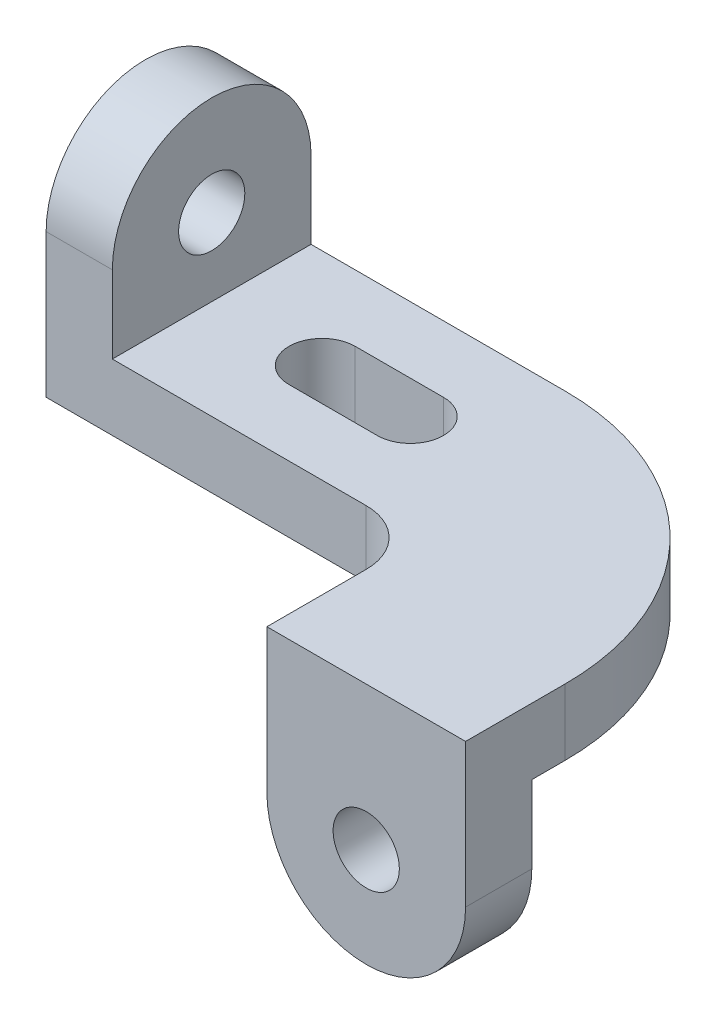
from build123d import *

# Parameters (mm, degrees)
BASE_EXTRUDE_DEPTH   = 19.05
BOSS_EXTRUDE1_DEPTH  = 19.05
BOSS_EXTRUDE2_DEPTH  = 19.05
SKETCH5_R            = 9.525
CUT_EXTRUDE1_DEPTH   = 207.057255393
SKETCH6_R            = 9.525
CUT_EXTRUDE2_DEPTH   = 286.735039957
SLOT_STRAIGHT1_DEPTH = 146.935482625


with BuildPart() as part:
    # Sketch2 → Base-Extrude (new body)
    with BuildSketch(Plane(origin=(0, 0, 0), x_dir=(1, 0, 0), z_dir=(0, 1, 0))):
        with BuildLine():
            Line((0, 0), (92.075, 0))
            ThreePointArc((92.075, 0), (103.300320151, -4.649679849), (107.95, -15.875))
            Line((107.95, -15.875), (107.95, -44.45))
            Line((107.95, -44.45), (165.1, -44.45))
            Line((165.1, -44.45), (165.1, -15.875))
            ThreePointArc((165.1, -15.875), (143.711472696, 35.761472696), (92.075, 57.15))
            Line((92.075, 57.15), (0, 57.15))
            Line((0, 57.15), (0, 0))
        make_face()
    extrude(amount=BASE_EXTRUDE_DEPTH)

    # Sketch3 → Boss-Extrude1 (add)
    with BuildSketch(Plane.XY.offset(44.45)):
        with BuildLine():
            Line((107.95, 19.05), (165.1, 19.05))
            Line((165.1, 19.05), (165.1, -22.225))
            ThreePointArc((165.1, -22.225), (136.525, -50.8), (107.95, -22.225))
            Line((107.95, -22.225), (107.95, 19.05))
        make_face()
    extrude(amount=-BOSS_EXTRUDE1_DEPTH)

    # Sketch4 → Boss-Extrude2 (add)
    with BuildSketch(Plane(origin=(0, -7.474026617, -157.650157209), x_dir=(0, 0, 1), z_dir=(1, 0, 0))):
        with BuildLine():
            Line((100.500157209, -7.474026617), (157.650157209, -7.474026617))
            Line((157.650157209, -7.474026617), (157.650157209, -48.749026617))
            ThreePointArc((157.650157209, -48.749026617), (129.075157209, -77.324026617), (100.500157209, -48.749026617))
            Line((100.500157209, -48.749026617), (100.500157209, -7.474026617))
        make_face()
    extrude(amount=BOSS_EXTRUDE2_DEPTH)

    # Sketch5 → Cut-Extrude1 (cut, through all)
    with BuildSketch(Plane.XY.offset(44.45)):
        with Locations((136.525, -22.225)):
            Circle(SKETCH5_R)
    extrude(amount=-CUT_EXTRUDE1_DEPTH, mode=Mode.SUBTRACT)

    # Sketch6 → Cut-Extrude2 (cut, through all)
    with BuildSketch(Plane(origin=(0, 63.684368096, -158.724389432), x_dir=(0, 0, 1), z_dir=(-1, 0, 0))):
        with Locations((130.149389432, -22.409368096)):
            Circle(SKETCH6_R)
    extrude(amount=-CUT_EXTRUDE2_DEPTH, mode=Mode.SUBTRACT)

    # Sketch7 → slot straight1 (cut, through all)
    with BuildSketch(Plane(origin=(70.933768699, 19.05, -42.445704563), x_dir=(-1, 0, 0), z_dir=(0, 1, 0))):
        with BuildLine():
            Line((-5.266231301, 23.395704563), (20.133768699, 23.395704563))
            ThreePointArc((20.133768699, 23.395704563), (29.658768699, 13.870704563), (20.133768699, 4.345704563))
            Line((20.133768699, 4.345704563), (-5.266231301, 4.345704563))
            ThreePointArc((-5.266231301, 4.345704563), (-14.791231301, 13.870704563), (-5.266231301, 23.395704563))
        make_face()
    extrude(amount=-SLOT_STRAIGHT1_DEPTH, mode=Mode.SUBTRACT)


solid = part.part
